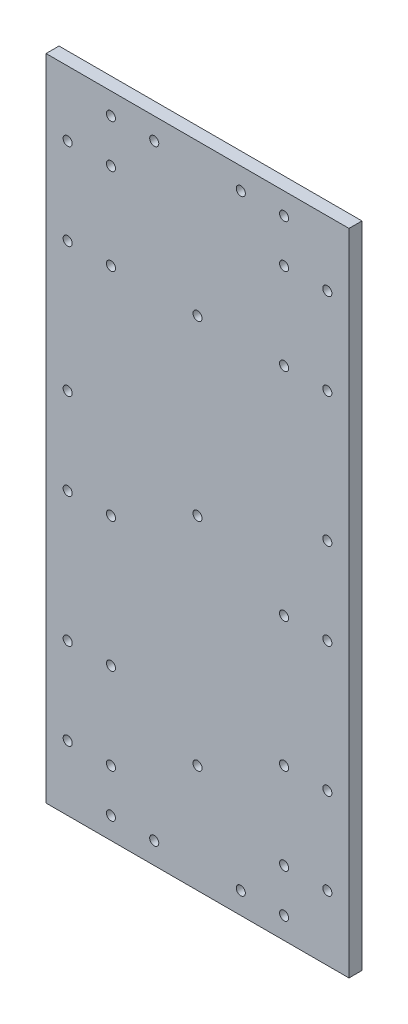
from build123d import *

# Parameters (mm, degrees)
CROQUIS1_W                = 140
CROQUIS1_H                = 300
SALIENTE_EXTRUIR1_DEPTH   = 6
TALADRO_ROSCADO_M5X0_81_D = 4.2


with BuildPart() as part:
    # Croquis1 → Saliente-Extruir1 (new body)
    with BuildSketch(Plane(origin=(0, 0, 0), x_dir=(-1, 0, 0), z_dir=(0, 0, -1))):
        with Locations((-70, 150)):
            Rectangle(CROQUIS1_W, CROQUIS1_H)
    extrude(amount=-SALIENTE_EXTRUIR1_DEPTH)

    # Taladro roscado M5x0.81 (through all)
    with Locations(Plane.XY.offset(6)):
        with Locations((90, 290), (130, 270), (110, 270), (30, 270), (10, 270), (130, 230), (110, 230), (10, 230), (30, 130), (110, 130), (10, 70), (130, 70), (70, 50), (10, 30), (130, 30), (110, 10), (50, 290), (30, 230), (130, 170), (130, 130), (10, 130), (10, 170), (30, 290), (110, 290), (90, 10), (50, 10), (30, 10), (110, 30), (110, 70), (30, 70), (30, 30), (70, 230), (70, 150)):
            Hole(TALADRO_ROSCADO_M5X0_81_D / 2)


solid = part.part
